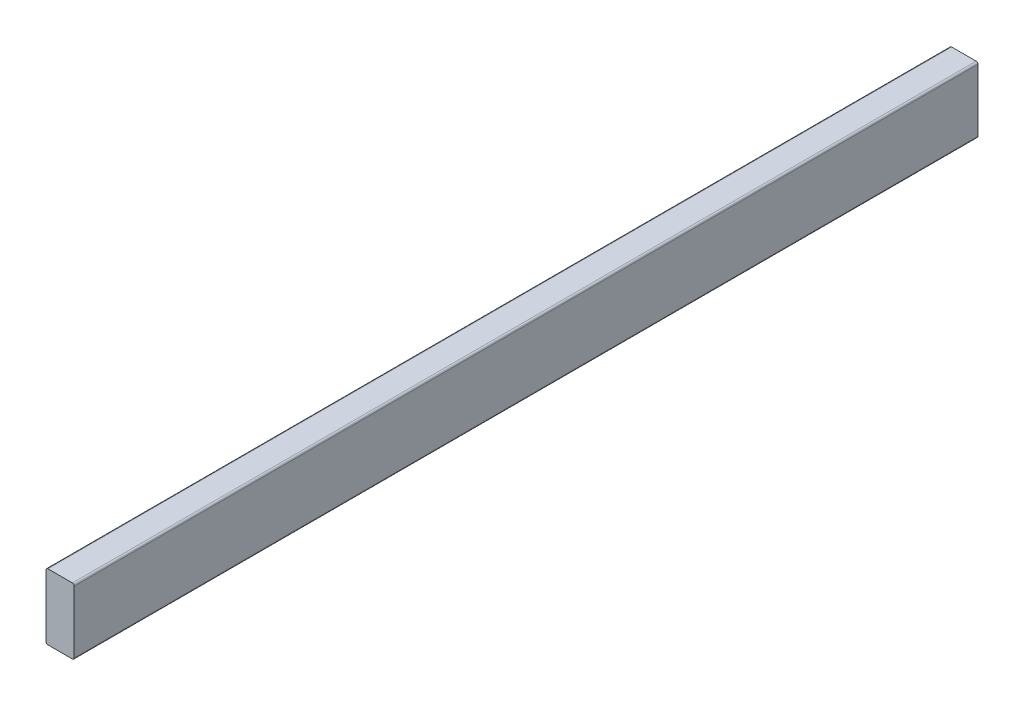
ISO-10303-21;
HEADER;
FILE_DESCRIPTION(('STEP AP214'),'2;1');
FILE_NAME('part.step','',(''),(''),'','','');
FILE_SCHEMA(('AUTOMOTIVE_DESIGN { 1 0 10303 214 1 1 1 1 }'));
ENDSEC;
DATA;
#1=APPLICATION_CONTEXT('core data for automotive mechanical design processes');
#2=APPLICATION_PROTOCOL_DEFINITION('international standard','automotive_design',2000,#1);
#3=PRODUCT_CONTEXT('',#1,'mechanical');
#4=PRODUCT('Part','Part','',(#3));
#5=PRODUCT_RELATED_PRODUCT_CATEGORY('part','',(#4));
#6=PRODUCT_DEFINITION_FORMATION('','',#4);
#7=PRODUCT_DEFINITION_CONTEXT('part definition',#1,'design');
#8=PRODUCT_DEFINITION('design','',#6,#7);
#9=PRODUCT_DEFINITION_SHAPE('','',#8);
#10=(LENGTH_UNIT() NAMED_UNIT(*) SI_UNIT(.MILLI.,.METRE.));
#11=(NAMED_UNIT(*) PLANE_ANGLE_UNIT() SI_UNIT($,.RADIAN.));
#12=(NAMED_UNIT(*) SI_UNIT($,.STERADIAN.) SOLID_ANGLE_UNIT());
#13=UNCERTAINTY_MEASURE_WITH_UNIT(LENGTH_MEASURE(1.E-05),#10,'distance_accuracy_value','');
#14=(GEOMETRIC_REPRESENTATION_CONTEXT(3) GLOBAL_UNCERTAINTY_ASSIGNED_CONTEXT((#13)) GLOBAL_UNIT_ASSIGNED_CONTEXT((#10,
#11,#12)) REPRESENTATION_CONTEXT('',''));
#15=CARTESIAN_POINT('',(0.,0.,0.));
#16=DIRECTION('',(0.,0.,1.));
#17=DIRECTION('',(1.,0.,0.));
#18=AXIS2_PLACEMENT_3D('',#15,#16,#17);
#19=CARTESIAN_POINT('',(19.05,-44.45,609.6));
#20=DIRECTION('',(-1.,0.,0.));
#21=DIRECTION('',(0.,-1.,0.));
#22=AXIS2_PLACEMENT_3D('',#19,#20,#21);
#23=PLANE('',#22);
#24=DIRECTION('',(0.,1.,0.));
#25=VECTOR('',#24,1.);
#26=CARTESIAN_POINT('',(19.05,-44.45,609.6));
#27=LINE('',#26,#25);
#28=CARTESIAN_POINT('',(19.05,-41.91,609.6));
#29=VERTEX_POINT('',#28);
#30=CARTESIAN_POINT('',(19.05,41.91,609.6));
#31=VERTEX_POINT('',#30);
#32=EDGE_CURVE('E130',#29,#31,#27,.T.);
#33=ORIENTED_EDGE('',*,*,#32,.F.);
#34=DIRECTION('',(0.,0.,-1.));
#35=VECTOR('',#34,1.);
#36=CARTESIAN_POINT('',(19.05,-41.91,609.6));
#37=LINE('',#36,#35);
#38=CARTESIAN_POINT('',(19.05,-41.91,-609.6));
#39=VERTEX_POINT('',#38);
#40=EDGE_CURVE('E156',#29,#39,#37,.T.);
#41=ORIENTED_EDGE('',*,*,#40,.T.);
#42=DIRECTION('',(0.,1.,0.));
#43=VECTOR('',#42,1.);
#44=CARTESIAN_POINT('',(19.05,-44.45,-609.6));
#45=LINE('',#44,#43);
#46=CARTESIAN_POINT('',(19.05,41.91,-609.6));
#47=VERTEX_POINT('',#46);
#48=EDGE_CURVE('E164',#39,#47,#45,.T.);
#49=ORIENTED_EDGE('',*,*,#48,.T.);
#50=DIRECTION('',(0.,0.,-1.));
#51=VECTOR('',#50,1.);
#52=CARTESIAN_POINT('',(19.05,41.91,609.6));
#53=LINE('',#52,#51);
#54=EDGE_CURVE('E154',#47,#31,#53,.F.);
#55=ORIENTED_EDGE('',*,*,#54,.T.);
#56=EDGE_LOOP('',(#33,#41,#49,#55));
#57=FACE_BOUND('',#56,.T.);
#58=ADVANCED_FACE('F39',(#57),#23,.F.);
#59=CARTESIAN_POINT('',(-19.05,44.45,609.6));
#60=DIRECTION('',(0.,-1.,0.));
#61=DIRECTION('',(1.,0.,0.));
#62=AXIS2_PLACEMENT_3D('',#59,#60,#61);
#63=PLANE('',#62);
#64=DIRECTION('',(-1.,0.,0.));
#65=VECTOR('',#64,1.);
#66=CARTESIAN_POINT('',(-19.05,44.45,-609.6));
#67=LINE('',#66,#65);
#68=CARTESIAN_POINT('',(16.51,44.45,-609.6));
#69=VERTEX_POINT('',#68);
#70=CARTESIAN_POINT('',(-16.51,44.45,-609.6));
#71=VERTEX_POINT('',#70);
#72=EDGE_CURVE('E135',#69,#71,#67,.T.);
#73=ORIENTED_EDGE('',*,*,#72,.T.);
#74=DIRECTION('',(0.,0.,-1.));
#75=VECTOR('',#74,1.);
#76=CARTESIAN_POINT('',(-16.51,44.45,609.6));
#77=LINE('',#76,#75);
#78=CARTESIAN_POINT('',(-16.51,44.45,609.6));
#79=VERTEX_POINT('',#78);
#80=EDGE_CURVE('E11',#71,#79,#77,.F.);
#81=ORIENTED_EDGE('',*,*,#80,.T.);
#82=DIRECTION('',(-1.,0.,0.));
#83=VECTOR('',#82,1.);
#84=CARTESIAN_POINT('',(-19.05,44.45,609.6));
#85=LINE('',#84,#83);
#86=CARTESIAN_POINT('',(16.51,44.45,609.6));
#87=VERTEX_POINT('',#86);
#88=EDGE_CURVE('E133',#87,#79,#85,.T.);
#89=ORIENTED_EDGE('',*,*,#88,.F.);
#90=DIRECTION('',(0.,0.,-1.));
#91=VECTOR('',#90,1.);
#92=CARTESIAN_POINT('',(16.51,44.45,609.6));
#93=LINE('',#92,#91);
#94=EDGE_CURVE('E47',#87,#69,#93,.T.);
#95=ORIENTED_EDGE('',*,*,#94,.T.);
#96=EDGE_LOOP('',(#73,#81,#89,#95));
#97=FACE_BOUND('',#96,.T.);
#98=ADVANCED_FACE('F161',(#97),#63,.F.);
#99=CARTESIAN_POINT('',(-19.05,-44.45,609.6));
#100=DIRECTION('',(1.,0.,0.));
#101=DIRECTION('',(0.,0.,-1.));
#102=AXIS2_PLACEMENT_3D('',#99,#100,#101);
#103=PLANE('',#102);
#104=DIRECTION('',(0.,-1.,0.));
#105=VECTOR('',#104,1.);
#106=CARTESIAN_POINT('',(-19.05,-44.45,-609.6));
#107=LINE('',#106,#105);
#108=CARTESIAN_POINT('',(-19.05,41.91,-609.6));
#109=VERTEX_POINT('',#108);
#110=CARTESIAN_POINT('',(-19.05,-41.91,-609.6));
#111=VERTEX_POINT('',#110);
#112=EDGE_CURVE('E131',#109,#111,#107,.T.);
#113=ORIENTED_EDGE('',*,*,#112,.T.);
#114=DIRECTION('',(0.,0.,-1.));
#115=VECTOR('',#114,1.);
#116=CARTESIAN_POINT('',(-19.05,-41.91,609.6));
#117=LINE('',#116,#115);
#118=CARTESIAN_POINT('',(-19.05,-41.91,609.6));
#119=VERTEX_POINT('',#118);
#120=EDGE_CURVE('E109',#111,#119,#117,.F.);
#121=ORIENTED_EDGE('',*,*,#120,.T.);
#122=DIRECTION('',(0.,-1.,0.));
#123=VECTOR('',#122,1.);
#124=CARTESIAN_POINT('',(-19.05,-44.45,609.6));
#125=LINE('',#124,#123);
#126=CARTESIAN_POINT('',(-19.05,41.91,609.6));
#127=VERTEX_POINT('',#126);
#128=EDGE_CURVE('E168',#127,#119,#125,.T.);
#129=ORIENTED_EDGE('',*,*,#128,.F.);
#130=DIRECTION('',(0.,0.,-1.));
#131=VECTOR('',#130,1.);
#132=CARTESIAN_POINT('',(-19.05,41.91,609.6));
#133=LINE('',#132,#131);
#134=EDGE_CURVE('E114',#127,#109,#133,.T.);
#135=ORIENTED_EDGE('',*,*,#134,.T.);
#136=EDGE_LOOP('',(#113,#121,#129,#135));
#137=FACE_BOUND('',#136,.T.);
#138=ADVANCED_FACE('F178',(#137),#103,.F.);
#139=CARTESIAN_POINT('',(-19.05,-44.45,609.6));
#140=DIRECTION('',(0.,1.,0.));
#141=DIRECTION('',(0.,0.,1.));
#142=AXIS2_PLACEMENT_3D('',#139,#140,#141);
#143=PLANE('',#142);
#144=DIRECTION('',(1.,0.,0.));
#145=VECTOR('',#144,1.);
#146=CARTESIAN_POINT('',(-19.05,-44.45,609.6));
#147=LINE('',#146,#145);
#148=CARTESIAN_POINT('',(-16.51,-44.45,609.6));
#149=VERTEX_POINT('',#148);
#150=CARTESIAN_POINT('',(16.51,-44.45,609.6));
#151=VERTEX_POINT('',#150);
#152=EDGE_CURVE('E124',#149,#151,#147,.T.);
#153=ORIENTED_EDGE('',*,*,#152,.F.);
#154=DIRECTION('',(0.,0.,-1.));
#155=VECTOR('',#154,1.);
#156=CARTESIAN_POINT('',(-16.51,-44.45,609.6));
#157=LINE('',#156,#155);
#158=CARTESIAN_POINT('',(-16.51,-44.45,-609.6));
#159=VERTEX_POINT('',#158);
#160=EDGE_CURVE('E108',#149,#159,#157,.T.);
#161=ORIENTED_EDGE('',*,*,#160,.T.);
#162=DIRECTION('',(1.,0.,0.));
#163=VECTOR('',#162,1.);
#164=CARTESIAN_POINT('',(-19.05,-44.45,-609.6));
#165=LINE('',#164,#163);
#166=CARTESIAN_POINT('',(16.51,-44.45,-609.6));
#167=VERTEX_POINT('',#166);
#168=EDGE_CURVE('E121',#159,#167,#165,.T.);
#169=ORIENTED_EDGE('',*,*,#168,.T.);
#170=DIRECTION('',(0.,0.,-1.));
#171=VECTOR('',#170,1.);
#172=CARTESIAN_POINT('',(16.51,-44.45,609.6));
#173=LINE('',#172,#171);
#174=EDGE_CURVE('E126',#167,#151,#173,.F.);
#175=ORIENTED_EDGE('',*,*,#174,.T.);
#176=EDGE_LOOP('',(#153,#161,#169,#175));
#177=FACE_BOUND('',#176,.T.);
#178=ADVANCED_FACE('F120',(#177),#143,.F.);
#179=CARTESIAN_POINT('',(0.,0.,609.6));
#180=DIRECTION('',(0.,0.,-1.));
#181=DIRECTION('',(-1.,0.,0.));
#182=AXIS2_PLACEMENT_3D('',#179,#180,#181);
#183=PLANE('',#182);
#184=ORIENTED_EDGE('',*,*,#128,.T.);
#185=CARTESIAN_POINT('',(-16.51,-41.91,609.6));
#186=DIRECTION('',(0.,0.,-1.));
#187=DIRECTION('',(-1.,0.,0.));
#188=AXIS2_PLACEMENT_3D('',#185,#186,#187);
#189=CIRCLE('',#188,2.54);
#190=EDGE_CURVE('E152',#119,#149,#189,.F.);
#191=ORIENTED_EDGE('',*,*,#190,.T.);
#192=ORIENTED_EDGE('',*,*,#152,.T.);
#193=CARTESIAN_POINT('',(16.51,-41.91,609.6));
#194=DIRECTION('',(0.,0.,-1.));
#195=DIRECTION('',(-1.,0.,0.));
#196=AXIS2_PLACEMENT_3D('',#193,#194,#195);
#197=CIRCLE('',#196,2.54);
#198=EDGE_CURVE('E150',#151,#29,#197,.F.);
#199=ORIENTED_EDGE('',*,*,#198,.T.);
#200=ORIENTED_EDGE('',*,*,#32,.T.);
#201=CARTESIAN_POINT('',(16.51,41.91,609.6));
#202=DIRECTION('',(0.,0.,-1.));
#203=DIRECTION('',(-1.,0.,0.));
#204=AXIS2_PLACEMENT_3D('',#201,#202,#203);
#205=CIRCLE('',#204,2.54);
#206=EDGE_CURVE('E59',#31,#87,#205,.F.);
#207=ORIENTED_EDGE('',*,*,#206,.T.);
#208=ORIENTED_EDGE('',*,*,#88,.T.);
#209=CARTESIAN_POINT('',(-16.51,41.91,609.6));
#210=DIRECTION('',(0.,0.,-1.));
#211=DIRECTION('',(-1.,0.,0.));
#212=AXIS2_PLACEMENT_3D('',#209,#210,#211);
#213=CIRCLE('',#212,2.54);
#214=EDGE_CURVE('E148',#79,#127,#213,.F.);
#215=ORIENTED_EDGE('',*,*,#214,.T.);
#216=EDGE_LOOP('',(#184,#191,#192,#199,#200,#207,#208,#215));
#217=FACE_BOUND('',#216,.T.);
#218=ADVANCED_FACE('F172',(#217),#183,.F.);
#219=CARTESIAN_POINT('',(0.,0.,-609.6));
#220=DIRECTION('',(0.,0.,-1.));
#221=DIRECTION('',(-1.,0.,0.));
#222=AXIS2_PLACEMENT_3D('',#219,#220,#221);
#223=PLANE('',#222);
#224=ORIENTED_EDGE('',*,*,#168,.F.);
#225=CARTESIAN_POINT('',(-16.51,-41.91,-609.6));
#226=DIRECTION('',(0.,0.,-1.));
#227=DIRECTION('',(-1.,0.,0.));
#228=AXIS2_PLACEMENT_3D('',#225,#226,#227);
#229=CIRCLE('',#228,2.54);
#230=EDGE_CURVE('E104',#159,#111,#229,.T.);
#231=ORIENTED_EDGE('',*,*,#230,.T.);
#232=ORIENTED_EDGE('',*,*,#112,.F.);
#233=CARTESIAN_POINT('',(-16.51,41.91,-609.6));
#234=DIRECTION('',(0.,0.,-1.));
#235=DIRECTION('',(-1.,0.,0.));
#236=AXIS2_PLACEMENT_3D('',#233,#234,#235);
#237=CIRCLE('',#236,2.54);
#238=EDGE_CURVE('E141',#109,#71,#237,.T.);
#239=ORIENTED_EDGE('',*,*,#238,.T.);
#240=ORIENTED_EDGE('',*,*,#72,.F.);
#241=CARTESIAN_POINT('',(16.51,41.91,-609.6));
#242=DIRECTION('',(0.,0.,-1.));
#243=DIRECTION('',(-1.,0.,0.));
#244=AXIS2_PLACEMENT_3D('',#241,#242,#243);
#245=CIRCLE('',#244,2.54);
#246=EDGE_CURVE('E125',#69,#47,#245,.T.);
#247=ORIENTED_EDGE('',*,*,#246,.T.);
#248=ORIENTED_EDGE('',*,*,#48,.F.);
#249=CARTESIAN_POINT('',(16.51,-41.91,-609.6));
#250=DIRECTION('',(0.,0.,-1.));
#251=DIRECTION('',(-1.,0.,0.));
#252=AXIS2_PLACEMENT_3D('',#249,#250,#251);
#253=CIRCLE('',#252,2.54);
#254=EDGE_CURVE('E115',#39,#167,#253,.T.);
#255=ORIENTED_EDGE('',*,*,#254,.T.);
#256=EDGE_LOOP('',(#224,#231,#232,#239,#240,#247,#248,#255));
#257=FACE_BOUND('',#256,.T.);
#258=ADVANCED_FACE('F128',(#257),#223,.T.);
#259=CARTESIAN_POINT('',(-16.51,-41.91,609.6));
#260=DIRECTION('',(0.,0.,-1.));
#261=DIRECTION('',(-1.,0.,0.));
#262=AXIS2_PLACEMENT_3D('',#259,#260,#261);
#263=CYLINDRICAL_SURFACE('',#262,2.54);
#264=ORIENTED_EDGE('',*,*,#190,.F.);
#265=ORIENTED_EDGE('',*,*,#120,.F.);
#266=ORIENTED_EDGE('',*,*,#230,.F.);
#267=ORIENTED_EDGE('',*,*,#160,.F.);
#268=EDGE_LOOP('',(#264,#265,#266,#267));
#269=FACE_BOUND('',#268,.T.);
#270=ADVANCED_FACE('F107',(#269),#263,.T.);
#271=CARTESIAN_POINT('',(16.51,-41.91,609.6));
#272=DIRECTION('',(0.,0.,-1.));
#273=DIRECTION('',(-1.,0.,0.));
#274=AXIS2_PLACEMENT_3D('',#271,#272,#273);
#275=CYLINDRICAL_SURFACE('',#274,2.54);
#276=ORIENTED_EDGE('',*,*,#198,.F.);
#277=ORIENTED_EDGE('',*,*,#174,.F.);
#278=ORIENTED_EDGE('',*,*,#254,.F.);
#279=ORIENTED_EDGE('',*,*,#40,.F.);
#280=EDGE_LOOP('',(#276,#277,#278,#279));
#281=FACE_BOUND('',#280,.T.);
#282=ADVANCED_FACE('F183',(#281),#275,.T.);
#283=CARTESIAN_POINT('',(-16.51,41.91,609.6));
#284=DIRECTION('',(0.,0.,-1.));
#285=DIRECTION('',(-1.,0.,0.));
#286=AXIS2_PLACEMENT_3D('',#283,#284,#285);
#287=CYLINDRICAL_SURFACE('',#286,2.54);
#288=ORIENTED_EDGE('',*,*,#214,.F.);
#289=ORIENTED_EDGE('',*,*,#80,.F.);
#290=ORIENTED_EDGE('',*,*,#238,.F.);
#291=ORIENTED_EDGE('',*,*,#134,.F.);
#292=EDGE_LOOP('',(#288,#289,#290,#291));
#293=FACE_BOUND('',#292,.T.);
#294=ADVANCED_FACE('F176',(#293),#287,.T.);
#295=CARTESIAN_POINT('',(16.51,41.91,609.6));
#296=DIRECTION('',(0.,0.,-1.));
#297=DIRECTION('',(-1.,0.,0.));
#298=AXIS2_PLACEMENT_3D('',#295,#296,#297);
#299=CYLINDRICAL_SURFACE('',#298,2.54);
#300=ORIENTED_EDGE('',*,*,#206,.F.);
#301=ORIENTED_EDGE('',*,*,#54,.F.);
#302=ORIENTED_EDGE('',*,*,#246,.F.);
#303=ORIENTED_EDGE('',*,*,#94,.F.);
#304=EDGE_LOOP('',(#300,#301,#302,#303));
#305=FACE_BOUND('',#304,.T.);
#306=ADVANCED_FACE('F41',(#305),#299,.T.);
#307=CLOSED_SHELL('',(#58,#98,#138,#178,#218,#258,#270,#282,#294,#306));
#308=MANIFOLD_SOLID_BREP('B2',#307);
#309=ADVANCED_BREP_SHAPE_REPRESENTATION('',(#18,#308),#14);
#310=SHAPE_DEFINITION_REPRESENTATION(#9,#309);
ENDSEC;
END-ISO-10303-21;
